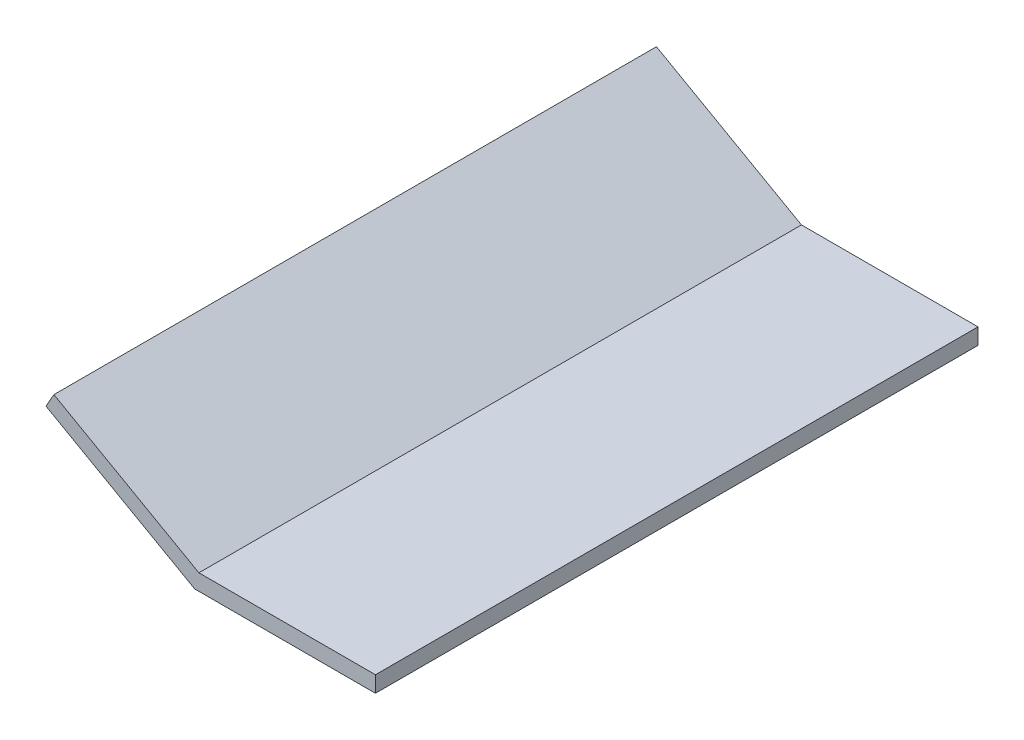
from build123d import *

# Parameters (mm, degrees)
BOSS_EXTRUDE1_DEPTH = 30


with BuildPart() as part:
    # Sketch1 → Boss-Extrude1 (new body)
    with BuildSketch(Plane.XY):
        Polygon((0, 0), (9, 0), (9, 0.8), (0.210174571, 0.8), (-7.009193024, 4.874547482), (-7.402402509, 4.177850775), align=None)
    extrude(amount=BOSS_EXTRUDE1_DEPTH)


solid = part.part
